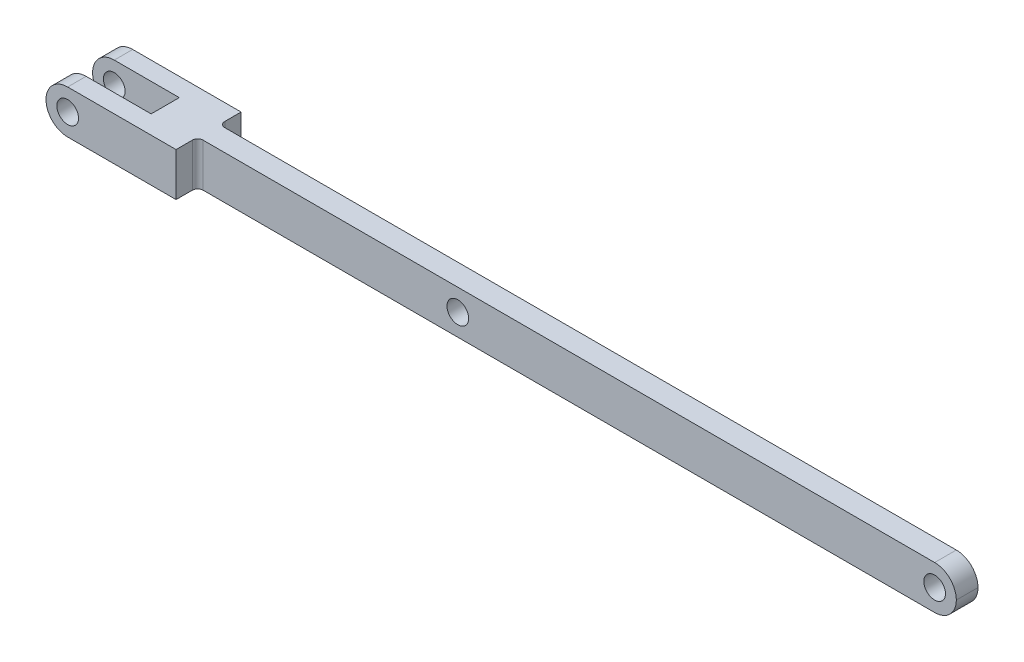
ISO-10303-21;
HEADER;
FILE_DESCRIPTION(('STEP AP214'),'2;1');
FILE_NAME('part.step','',(''),(''),'','','');
FILE_SCHEMA(('AUTOMOTIVE_DESIGN { 1 0 10303 214 1 1 1 1 }'));
ENDSEC;
DATA;
#1=APPLICATION_CONTEXT('core data for automotive mechanical design processes');
#2=APPLICATION_PROTOCOL_DEFINITION('international standard','automotive_design',2000,#1);
#3=PRODUCT_CONTEXT('',#1,'mechanical');
#4=PRODUCT('Part','Part','',(#3));
#5=PRODUCT_RELATED_PRODUCT_CATEGORY('part','',(#4));
#6=PRODUCT_DEFINITION_FORMATION('','',#4);
#7=PRODUCT_DEFINITION_CONTEXT('part definition',#1,'design');
#8=PRODUCT_DEFINITION('design','',#6,#7);
#9=PRODUCT_DEFINITION_SHAPE('','',#8);
#10=(LENGTH_UNIT() NAMED_UNIT(*) SI_UNIT(.MILLI.,.METRE.));
#11=(NAMED_UNIT(*) PLANE_ANGLE_UNIT() SI_UNIT($,.RADIAN.));
#12=(NAMED_UNIT(*) SI_UNIT($,.STERADIAN.) SOLID_ANGLE_UNIT());
#13=UNCERTAINTY_MEASURE_WITH_UNIT(LENGTH_MEASURE(1.E-05),#10,'distance_accuracy_value','');
#14=(GEOMETRIC_REPRESENTATION_CONTEXT(3) GLOBAL_UNCERTAINTY_ASSIGNED_CONTEXT((#13)) GLOBAL_UNIT_ASSIGNED_CONTEXT((#10,
#11,#12)) REPRESENTATION_CONTEXT('',''));
#15=CARTESIAN_POINT('',(0.,0.,0.));
#16=DIRECTION('',(0.,0.,1.));
#17=DIRECTION('',(1.,0.,0.));
#18=AXIS2_PLACEMENT_3D('',#15,#16,#17);
#19=CARTESIAN_POINT('',(0.,0.,10.));
#20=DIRECTION('',(0.,0.,-1.));
#21=DIRECTION('',(-1.,0.,0.));
#22=AXIS2_PLACEMENT_3D('',#19,#20,#21);
#23=CYLINDRICAL_SURFACE('',#22,20.);
#24=CARTESIAN_POINT('',(0.,0.,-13.));
#25=DIRECTION('',(0.,0.,-1.));
#26=DIRECTION('',(-1.,0.,0.));
#27=AXIS2_PLACEMENT_3D('',#24,#25,#26);
#28=CIRCLE('',#27,20.);
#29=CARTESIAN_POINT('',(0.,-20.,-13.));
#30=VERTEX_POINT('',#29);
#31=CARTESIAN_POINT('',(0.,20.,-13.));
#32=VERTEX_POINT('',#31);
#33=EDGE_CURVE('E153',#30,#32,#28,.T.);
#34=ORIENTED_EDGE('',*,*,#33,.T.);
#35=DIRECTION('',(0.,0.,-1.));
#36=VECTOR('',#35,1.);
#37=CARTESIAN_POINT('',(0.,20.,10.));
#38=LINE('',#37,#36);
#39=CARTESIAN_POINT('',(0.,20.,-30.));
#40=VERTEX_POINT('',#39);
#41=EDGE_CURVE('E246',#32,#40,#38,.T.);
#42=ORIENTED_EDGE('',*,*,#41,.T.);
#43=CARTESIAN_POINT('',(0.,0.,-30.));
#44=DIRECTION('',(0.,0.,1.));
#45=DIRECTION('',(1.,0.,0.));
#46=AXIS2_PLACEMENT_3D('',#43,#44,#45);
#47=CIRCLE('',#46,20.);
#48=CARTESIAN_POINT('',(0.,-20.,-30.));
#49=VERTEX_POINT('',#48);
#50=EDGE_CURVE('E184',#40,#49,#47,.T.);
#51=ORIENTED_EDGE('',*,*,#50,.T.);
#52=DIRECTION('',(0.,0.,-1.));
#53=VECTOR('',#52,1.);
#54=CARTESIAN_POINT('',(0.,-20.,10.));
#55=LINE('',#54,#53);
#56=EDGE_CURVE('E253',#30,#49,#55,.T.);
#57=ORIENTED_EDGE('',*,*,#56,.F.);
#58=EDGE_LOOP('',(#34,#42,#51,#57));
#59=FACE_BOUND('',#58,.T.);
#60=ADVANCED_FACE('F39',(#59),#23,.T.);
#61=CARTESIAN_POINT('',(0.,20.,30.));
#62=VERTEX_POINT('',#61);
#63=CARTESIAN_POINT('',(0.,20.,13.));
#64=VERTEX_POINT('',#63);
#65=EDGE_CURVE('E250',#62,#64,#38,.T.);
#66=ORIENTED_EDGE('',*,*,#65,.T.);
#67=CARTESIAN_POINT('',(0.,0.,13.));
#68=DIRECTION('',(0.,0.,1.));
#69=DIRECTION('',(1.,0.,0.));
#70=AXIS2_PLACEMENT_3D('',#67,#68,#69);
#71=CIRCLE('',#70,20.);
#72=CARTESIAN_POINT('',(0.,-20.,13.));
#73=VERTEX_POINT('',#72);
#74=EDGE_CURVE('E168',#64,#73,#71,.T.);
#75=ORIENTED_EDGE('',*,*,#74,.T.);
#76=CARTESIAN_POINT('',(0.,-20.,30.));
#77=VERTEX_POINT('',#76);
#78=EDGE_CURVE('E167',#77,#73,#55,.T.);
#79=ORIENTED_EDGE('',*,*,#78,.F.);
#80=CARTESIAN_POINT('',(0.,0.,30.));
#81=DIRECTION('',(0.,0.,1.));
#82=DIRECTION('',(1.,0.,0.));
#83=AXIS2_PLACEMENT_3D('',#80,#81,#82);
#84=CIRCLE('',#83,20.);
#85=EDGE_CURVE('E191',#62,#77,#84,.T.);
#86=ORIENTED_EDGE('',*,*,#85,.F.);
#87=EDGE_LOOP('',(#66,#75,#79,#86));
#88=FACE_BOUND('',#87,.T.);
#89=ADVANCED_FACE('F41',(#88),#23,.T.);
#90=CARTESIAN_POINT('',(0.,-20.,10.));
#91=DIRECTION('',(0.,1.,0.));
#92=DIRECTION('',(0.,0.,1.));
#93=AXIS2_PLACEMENT_3D('',#90,#91,#92);
#94=PLANE('',#93);
#95=DIRECTION('',(1.,0.,0.));
#96=VECTOR('',#95,1.);
#97=CARTESIAN_POINT('',(0.,-20.,-10.));
#98=LINE('',#97,#96);
#99=CARTESIAN_POINT('',(105.,-20.,-10.));
#100=VERTEX_POINT('',#99);
#101=CARTESIAN_POINT('',(780.,-20.,-10.));
#102=VERTEX_POINT('',#101);
#103=EDGE_CURVE('E205',#100,#102,#98,.T.);
#104=ORIENTED_EDGE('',*,*,#103,.T.);
#105=DIRECTION('',(0.,0.,-1.));
#106=VECTOR('',#105,1.);
#107=CARTESIAN_POINT('',(780.,-20.,10.));
#108=LINE('',#107,#106);
#109=CARTESIAN_POINT('',(780.,-20.,10.));
#110=VERTEX_POINT('',#109);
#111=EDGE_CURVE('E240',#102,#110,#108,.F.);
#112=ORIENTED_EDGE('',*,*,#111,.T.);
#113=DIRECTION('',(1.,0.,0.));
#114=VECTOR('',#113,1.);
#115=CARTESIAN_POINT('',(0.,-20.,10.));
#116=LINE('',#115,#114);
#117=CARTESIAN_POINT('',(105.,-20.,10.));
#118=VERTEX_POINT('',#117);
#119=EDGE_CURVE('E236',#118,#110,#116,.T.);
#120=ORIENTED_EDGE('',*,*,#119,.F.);
#121=CARTESIAN_POINT('',(105.,-20.,15.));
#122=DIRECTION('',(0.,1.,0.));
#123=DIRECTION('',(0.,0.,1.));
#124=AXIS2_PLACEMENT_3D('',#121,#122,#123);
#125=CIRCLE('',#124,5.);
#126=CARTESIAN_POINT('',(100.,-20.,15.));
#127=VERTEX_POINT('',#126);
#128=EDGE_CURVE('E220',#118,#127,#125,.T.);
#129=ORIENTED_EDGE('',*,*,#128,.T.);
#130=DIRECTION('',(0.,0.,-1.));
#131=VECTOR('',#130,1.);
#132=CARTESIAN_POINT('',(100.,-20.,30.));
#133=LINE('',#132,#131);
#134=CARTESIAN_POINT('',(100.,-20.,30.));
#135=VERTEX_POINT('',#134);
#136=EDGE_CURVE('E209',#135,#127,#133,.T.);
#137=ORIENTED_EDGE('',*,*,#136,.F.);
#138=DIRECTION('',(1.,0.,0.));
#139=VECTOR('',#138,1.);
#140=CARTESIAN_POINT('',(0.,-20.,30.));
#141=LINE('',#140,#139);
#142=EDGE_CURVE('E195',#77,#135,#141,.T.);
#143=ORIENTED_EDGE('',*,*,#142,.F.);
#144=ORIENTED_EDGE('',*,*,#78,.T.);
#145=DIRECTION('',(1.,0.,0.));
#146=VECTOR('',#145,1.);
#147=CARTESIAN_POINT('',(0.,-20.,13.));
#148=LINE('',#147,#146);
#149=CARTESIAN_POINT('',(60.,-20.,13.));
#150=VERTEX_POINT('',#149);
#151=EDGE_CURVE('E154',#73,#150,#148,.T.);
#152=ORIENTED_EDGE('',*,*,#151,.T.);
#153=DIRECTION('',(0.,0.,-1.));
#154=VECTOR('',#153,1.);
#155=CARTESIAN_POINT('',(60.,-20.,10.));
#156=LINE('',#155,#154);
#157=CARTESIAN_POINT('',(60.,-20.,-13.));
#158=VERTEX_POINT('',#157);
#159=EDGE_CURVE('E143',#150,#158,#156,.T.);
#160=ORIENTED_EDGE('',*,*,#159,.T.);
#161=DIRECTION('',(-1.,0.,0.));
#162=VECTOR('',#161,1.);
#163=CARTESIAN_POINT('',(0.,-20.,-13.));
#164=LINE('',#163,#162);
#165=EDGE_CURVE('E173',#158,#30,#164,.T.);
#166=ORIENTED_EDGE('',*,*,#165,.T.);
#167=ORIENTED_EDGE('',*,*,#56,.T.);
#168=DIRECTION('',(1.,0.,0.));
#169=VECTOR('',#168,1.);
#170=CARTESIAN_POINT('',(0.,-20.,-30.));
#171=LINE('',#170,#169);
#172=CARTESIAN_POINT('',(100.,-20.,-30.));
#173=VERTEX_POINT('',#172);
#174=EDGE_CURVE('E181',#49,#173,#171,.T.);
#175=ORIENTED_EDGE('',*,*,#174,.T.);
#176=DIRECTION('',(0.,0.,1.));
#177=VECTOR('',#176,1.);
#178=CARTESIAN_POINT('',(100.,-20.,-30.));
#179=LINE('',#178,#177);
#180=CARTESIAN_POINT('',(100.,-20.,-15.));
#181=VERTEX_POINT('',#180);
#182=EDGE_CURVE('E187',#173,#181,#179,.T.);
#183=ORIENTED_EDGE('',*,*,#182,.T.);
#184=CARTESIAN_POINT('',(105.,-20.,-15.));
#185=DIRECTION('',(0.,1.,0.));
#186=DIRECTION('',(0.,0.,1.));
#187=AXIS2_PLACEMENT_3D('',#184,#185,#186);
#188=CIRCLE('',#187,5.);
#189=EDGE_CURVE('E224',#181,#100,#188,.T.);
#190=ORIENTED_EDGE('',*,*,#189,.T.);
#191=EDGE_LOOP('',(#104,#112,#120,#129,#137,#143,#144,#152,#160,#166,#167,#175,#183,#190));
#192=FACE_BOUND('',#191,.T.);
#193=ADVANCED_FACE('F165',(#192),#94,.F.);
#194=CARTESIAN_POINT('',(0.,20.,10.));
#195=DIRECTION('',(0.,-1.,0.));
#196=DIRECTION('',(0.,0.,-1.));
#197=AXIS2_PLACEMENT_3D('',#194,#195,#196);
#198=PLANE('',#197);
#199=DIRECTION('',(-1.,0.,0.));
#200=VECTOR('',#199,1.);
#201=CARTESIAN_POINT('',(0.,20.,10.));
#202=LINE('',#201,#200);
#203=CARTESIAN_POINT('',(780.,20.,10.));
#204=VERTEX_POINT('',#203);
#205=CARTESIAN_POINT('',(105.,20.,10.));
#206=VERTEX_POINT('',#205);
#207=EDGE_CURVE('E243',#204,#206,#202,.T.);
#208=ORIENTED_EDGE('',*,*,#207,.F.);
#209=DIRECTION('',(0.,0.,-1.));
#210=VECTOR('',#209,1.);
#211=CARTESIAN_POINT('',(780.,20.,10.));
#212=LINE('',#211,#210);
#213=CARTESIAN_POINT('',(780.,20.,-10.));
#214=VERTEX_POINT('',#213);
#215=EDGE_CURVE('E11',#204,#214,#212,.T.);
#216=ORIENTED_EDGE('',*,*,#215,.T.);
#217=DIRECTION('',(-1.,0.,0.));
#218=VECTOR('',#217,1.);
#219=CARTESIAN_POINT('',(0.,20.,-10.));
#220=LINE('',#219,#218);
#221=CARTESIAN_POINT('',(105.,20.,-10.));
#222=VERTEX_POINT('',#221);
#223=EDGE_CURVE('E208',#214,#222,#220,.T.);
#224=ORIENTED_EDGE('',*,*,#223,.T.);
#225=CARTESIAN_POINT('',(105.,20.,-15.));
#226=DIRECTION('',(0.,-1.,0.));
#227=DIRECTION('',(0.,0.,-1.));
#228=AXIS2_PLACEMENT_3D('',#225,#226,#227);
#229=CIRCLE('',#228,5.);
#230=CARTESIAN_POINT('',(100.,20.,-15.));
#231=VERTEX_POINT('',#230);
#232=EDGE_CURVE('E222',#222,#231,#229,.T.);
#233=ORIENTED_EDGE('',*,*,#232,.T.);
#234=DIRECTION('',(0.,0.,1.));
#235=VECTOR('',#234,1.);
#236=CARTESIAN_POINT('',(100.,20.,-30.));
#237=LINE('',#236,#235);
#238=CARTESIAN_POINT('',(100.,20.,-30.));
#239=VERTEX_POINT('',#238);
#240=EDGE_CURVE('E192',#239,#231,#237,.T.);
#241=ORIENTED_EDGE('',*,*,#240,.F.);
#242=DIRECTION('',(-1.,0.,0.));
#243=VECTOR('',#242,1.);
#244=CARTESIAN_POINT('',(100.,20.,-30.));
#245=LINE('',#244,#243);
#246=EDGE_CURVE('E175',#239,#40,#245,.T.);
#247=ORIENTED_EDGE('',*,*,#246,.T.);
#248=ORIENTED_EDGE('',*,*,#41,.F.);
#249=DIRECTION('',(1.,0.,0.));
#250=VECTOR('',#249,1.);
#251=CARTESIAN_POINT('',(0.,20.,-13.));
#252=LINE('',#251,#250);
#253=CARTESIAN_POINT('',(60.,20.,-13.));
#254=VERTEX_POINT('',#253);
#255=EDGE_CURVE('E274',#32,#254,#252,.T.);
#256=ORIENTED_EDGE('',*,*,#255,.T.);
#257=DIRECTION('',(0.,0.,1.));
#258=VECTOR('',#257,1.);
#259=CARTESIAN_POINT('',(60.,20.,10.));
#260=LINE('',#259,#258);
#261=CARTESIAN_POINT('',(60.,20.,13.));
#262=VERTEX_POINT('',#261);
#263=EDGE_CURVE('E272',#254,#262,#260,.T.);
#264=ORIENTED_EDGE('',*,*,#263,.T.);
#265=DIRECTION('',(-1.,0.,0.));
#266=VECTOR('',#265,1.);
#267=CARTESIAN_POINT('',(0.,20.,13.));
#268=LINE('',#267,#266);
#269=EDGE_CURVE('E160',#262,#64,#268,.T.);
#270=ORIENTED_EDGE('',*,*,#269,.T.);
#271=ORIENTED_EDGE('',*,*,#65,.F.);
#272=DIRECTION('',(-1.,0.,0.));
#273=VECTOR('',#272,1.);
#274=CARTESIAN_POINT('',(100.,20.,30.));
#275=LINE('',#274,#273);
#276=CARTESIAN_POINT('',(100.,20.,30.));
#277=VERTEX_POINT('',#276);
#278=EDGE_CURVE('E188',#277,#62,#275,.T.);
#279=ORIENTED_EDGE('',*,*,#278,.F.);
#280=DIRECTION('',(0.,0.,-1.));
#281=VECTOR('',#280,1.);
#282=CARTESIAN_POINT('',(100.,20.,30.));
#283=LINE('',#282,#281);
#284=CARTESIAN_POINT('',(100.,20.,15.));
#285=VERTEX_POINT('',#284);
#286=EDGE_CURVE('E199',#277,#285,#283,.T.);
#287=ORIENTED_EDGE('',*,*,#286,.T.);
#288=CARTESIAN_POINT('',(105.,20.,15.));
#289=DIRECTION('',(0.,-1.,0.));
#290=DIRECTION('',(0.,0.,-1.));
#291=AXIS2_PLACEMENT_3D('',#288,#289,#290);
#292=CIRCLE('',#291,5.);
#293=EDGE_CURVE('E217',#285,#206,#292,.T.);
#294=ORIENTED_EDGE('',*,*,#293,.T.);
#295=EDGE_LOOP('',(#208,#216,#224,#233,#241,#247,#248,#256,#264,#270,#271,#279,#287,#294));
#296=FACE_BOUND('',#295,.T.);
#297=ADVANCED_FACE('F299',(#296),#198,.F.);
#298=CARTESIAN_POINT('',(0.,0.,10.));
#299=DIRECTION('',(0.,0.,1.));
#300=DIRECTION('',(1.,0.,0.));
#301=AXIS2_PLACEMENT_3D('',#298,#299,#300);
#302=PLANE('',#301);
#303=CARTESIAN_POINT('',(780.,0.,10.));
#304=DIRECTION('',(0.,0.,1.));
#305=DIRECTION('',(1.,0.,0.));
#306=AXIS2_PLACEMENT_3D('',#303,#304,#305);
#307=CIRCLE('',#306,9.99999999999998);
#308=CARTESIAN_POINT('',(790.,0.,10.));
#309=VERTEX_POINT('',#308);
#310=EDGE_CURVE('E234',#309,#309,#307,.T.);
#311=ORIENTED_EDGE('',*,*,#310,.F.);
#312=EDGE_LOOP('',(#311));
#313=FACE_BOUND('',#312,.T.);
#314=CARTESIAN_POINT('',(340.,0.,10.));
#315=DIRECTION('',(0.,0.,1.));
#316=DIRECTION('',(1.,0.,0.));
#317=AXIS2_PLACEMENT_3D('',#314,#315,#316);
#318=CIRCLE('',#317,10.);
#319=CARTESIAN_POINT('',(350.,0.,10.));
#320=VERTEX_POINT('',#319);
#321=EDGE_CURVE('E230',#320,#320,#318,.T.);
#322=ORIENTED_EDGE('',*,*,#321,.F.);
#323=EDGE_LOOP('',(#322));
#324=FACE_BOUND('',#323,.T.);
#325=ORIENTED_EDGE('',*,*,#119,.T.);
#326=CARTESIAN_POINT('',(780.,0.,10.));
#327=DIRECTION('',(0.,0.,1.));
#328=DIRECTION('',(1.,0.,0.));
#329=AXIS2_PLACEMENT_3D('',#326,#327,#328);
#330=CIRCLE('',#329,20.);
#331=CARTESIAN_POINT('',(800.,0.,10.));
#332=VERTEX_POINT('',#331);
#333=EDGE_CURVE('E47',#110,#332,#330,.T.);
#334=ORIENTED_EDGE('',*,*,#333,.T.);
#335=CARTESIAN_POINT('',(780.,0.,10.));
#336=DIRECTION('',(0.,0.,1.));
#337=DIRECTION('',(1.,0.,0.));
#338=AXIS2_PLACEMENT_3D('',#335,#336,#337);
#339=CIRCLE('',#338,20.);
#340=EDGE_CURVE('E57',#332,#204,#339,.T.);
#341=ORIENTED_EDGE('',*,*,#340,.T.);
#342=ORIENTED_EDGE('',*,*,#207,.T.);
#343=DIRECTION('',(0.,1.,0.));
#344=VECTOR('',#343,1.);
#345=CARTESIAN_POINT('',(105.,0.,10.));
#346=LINE('',#345,#344);
#347=EDGE_CURVE('E210',#206,#118,#346,.F.);
#348=ORIENTED_EDGE('',*,*,#347,.T.);
#349=EDGE_LOOP('',(#325,#334,#341,#342,#348));
#350=FACE_BOUND('',#349,.T.);
#351=ADVANCED_FACE('F285',(#313,#324,#350),#302,.T.);
#352=CARTESIAN_POINT('',(0.,0.,-10.));
#353=DIRECTION('',(0.,0.,1.));
#354=DIRECTION('',(1.,0.,0.));
#355=AXIS2_PLACEMENT_3D('',#352,#353,#354);
#356=PLANE('',#355);
#357=CARTESIAN_POINT('',(780.,0.,-10.));
#358=DIRECTION('',(0.,0.,1.));
#359=DIRECTION('',(1.,0.,0.));
#360=AXIS2_PLACEMENT_3D('',#357,#358,#359);
#361=CIRCLE('',#360,9.99999999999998);
#362=CARTESIAN_POINT('',(790.,0.,-10.));
#363=VERTEX_POINT('',#362);
#364=EDGE_CURVE('E231',#363,#363,#361,.T.);
#365=ORIENTED_EDGE('',*,*,#364,.T.);
#366=EDGE_LOOP('',(#365));
#367=FACE_BOUND('',#366,.T.);
#368=CARTESIAN_POINT('',(340.,0.,-10.));
#369=DIRECTION('',(0.,0.,1.));
#370=DIRECTION('',(1.,0.,0.));
#371=AXIS2_PLACEMENT_3D('',#368,#369,#370);
#372=CIRCLE('',#371,10.);
#373=CARTESIAN_POINT('',(350.,0.,-10.));
#374=VERTEX_POINT('',#373);
#375=EDGE_CURVE('E227',#374,#374,#372,.T.);
#376=ORIENTED_EDGE('',*,*,#375,.T.);
#377=EDGE_LOOP('',(#376));
#378=FACE_BOUND('',#377,.T.);
#379=CARTESIAN_POINT('',(780.,0.,-10.));
#380=DIRECTION('',(0.,0.,1.));
#381=DIRECTION('',(1.,0.,0.));
#382=AXIS2_PLACEMENT_3D('',#379,#380,#381);
#383=CIRCLE('',#382,20.);
#384=CARTESIAN_POINT('',(800.,0.,-10.));
#385=VERTEX_POINT('',#384);
#386=EDGE_CURVE('E226',#214,#385,#383,.F.);
#387=ORIENTED_EDGE('',*,*,#386,.T.);
#388=CARTESIAN_POINT('',(780.,0.,-10.));
#389=DIRECTION('',(0.,0.,1.));
#390=DIRECTION('',(1.,0.,0.));
#391=AXIS2_PLACEMENT_3D('',#388,#389,#390);
#392=CIRCLE('',#391,20.);
#393=EDGE_CURVE('E238',#385,#102,#392,.F.);
#394=ORIENTED_EDGE('',*,*,#393,.T.);
#395=ORIENTED_EDGE('',*,*,#103,.F.);
#396=DIRECTION('',(0.,1.,0.));
#397=VECTOR('',#396,1.);
#398=CARTESIAN_POINT('',(105.,0.,-10.));
#399=LINE('',#398,#397);
#400=EDGE_CURVE('E212',#100,#222,#399,.T.);
#401=ORIENTED_EDGE('',*,*,#400,.T.);
#402=ORIENTED_EDGE('',*,*,#223,.F.);
#403=EDGE_LOOP('',(#387,#394,#395,#401,#402));
#404=FACE_BOUND('',#403,.T.);
#405=ADVANCED_FACE('F333',(#367,#378,#404),#356,.F.);
#406=CARTESIAN_POINT('',(100.,20.,30.));
#407=DIRECTION('',(-1.,0.,0.));
#408=DIRECTION('',(0.,0.,1.));
#409=AXIS2_PLACEMENT_3D('',#406,#407,#408);
#410=PLANE('',#409);
#411=ORIENTED_EDGE('',*,*,#136,.T.);
#412=DIRECTION('',(0.,1.,0.));
#413=VECTOR('',#412,1.);
#414=CARTESIAN_POINT('',(100.,20.,15.));
#415=LINE('',#414,#413);
#416=EDGE_CURVE('E277',#127,#285,#415,.T.);
#417=ORIENTED_EDGE('',*,*,#416,.T.);
#418=ORIENTED_EDGE('',*,*,#286,.F.);
#419=DIRECTION('',(0.,1.,0.));
#420=VECTOR('',#419,1.);
#421=CARTESIAN_POINT('',(100.,20.,30.));
#422=LINE('',#421,#420);
#423=EDGE_CURVE('E197',#135,#277,#422,.T.);
#424=ORIENTED_EDGE('',*,*,#423,.F.);
#425=EDGE_LOOP('',(#411,#417,#418,#424));
#426=FACE_BOUND('',#425,.T.);
#427=ADVANCED_FACE('F295',(#426),#410,.F.);
#428=CARTESIAN_POINT('',(0.,0.,30.));
#429=DIRECTION('',(0.,0.,1.));
#430=DIRECTION('',(1.,0.,0.));
#431=AXIS2_PLACEMENT_3D('',#428,#429,#430);
#432=PLANE('',#431);
#433=CARTESIAN_POINT('',(0.,0.,30.));
#434=DIRECTION('',(0.,0.,1.));
#435=DIRECTION('',(1.,0.,0.));
#436=AXIS2_PLACEMENT_3D('',#433,#434,#435);
#437=CIRCLE('',#436,10.);
#438=CARTESIAN_POINT('',(10.,0.,30.));
#439=VERTEX_POINT('',#438);
#440=EDGE_CURVE('E282',#439,#439,#437,.T.);
#441=ORIENTED_EDGE('',*,*,#440,.F.);
#442=EDGE_LOOP('',(#441));
#443=FACE_BOUND('',#442,.T.);
#444=ORIENTED_EDGE('',*,*,#278,.T.);
#445=ORIENTED_EDGE('',*,*,#85,.T.);
#446=ORIENTED_EDGE('',*,*,#142,.T.);
#447=ORIENTED_EDGE('',*,*,#423,.T.);
#448=EDGE_LOOP('',(#444,#445,#446,#447));
#449=FACE_BOUND('',#448,.T.);
#450=ADVANCED_FACE('F302',(#443,#449),#432,.T.);
#451=CARTESIAN_POINT('',(100.,20.,-30.));
#452=DIRECTION('',(1.,0.,0.));
#453=DIRECTION('',(0.,0.,-1.));
#454=AXIS2_PLACEMENT_3D('',#451,#452,#453);
#455=PLANE('',#454);
#456=ORIENTED_EDGE('',*,*,#240,.T.);
#457=DIRECTION('',(0.,1.,0.));
#458=VECTOR('',#457,1.);
#459=CARTESIAN_POINT('',(100.,20.,-15.));
#460=LINE('',#459,#458);
#461=EDGE_CURVE('E215',#231,#181,#460,.F.);
#462=ORIENTED_EDGE('',*,*,#461,.T.);
#463=ORIENTED_EDGE('',*,*,#182,.F.);
#464=DIRECTION('',(0.,1.,0.));
#465=VECTOR('',#464,1.);
#466=CARTESIAN_POINT('',(100.,20.,-30.));
#467=LINE('',#466,#465);
#468=EDGE_CURVE('E178',#173,#239,#467,.T.);
#469=ORIENTED_EDGE('',*,*,#468,.T.);
#470=EDGE_LOOP('',(#456,#462,#463,#469));
#471=FACE_BOUND('',#470,.T.);
#472=ADVANCED_FACE('F342',(#471),#455,.T.);
#473=CARTESIAN_POINT('',(0.,0.,-30.));
#474=DIRECTION('',(0.,0.,-1.));
#475=DIRECTION('',(1.,0.,0.));
#476=AXIS2_PLACEMENT_3D('',#473,#474,#475);
#477=PLANE('',#476);
#478=CARTESIAN_POINT('',(0.,0.,-30.));
#479=DIRECTION('',(0.,0.,-1.));
#480=DIRECTION('',(-1.,0.,0.));
#481=AXIS2_PLACEMENT_3D('',#478,#479,#480);
#482=CIRCLE('',#481,10.);
#483=CARTESIAN_POINT('',(-10.,0.,-30.));
#484=VERTEX_POINT('',#483);
#485=EDGE_CURVE('E161',#484,#484,#482,.T.);
#486=ORIENTED_EDGE('',*,*,#485,.F.);
#487=EDGE_LOOP('',(#486));
#488=FACE_BOUND('',#487,.T.);
#489=ORIENTED_EDGE('',*,*,#246,.F.);
#490=ORIENTED_EDGE('',*,*,#468,.F.);
#491=ORIENTED_EDGE('',*,*,#174,.F.);
#492=ORIENTED_EDGE('',*,*,#50,.F.);
#493=EDGE_LOOP('',(#489,#490,#491,#492));
#494=FACE_BOUND('',#493,.T.);
#495=ADVANCED_FACE('F346',(#488,#494),#477,.T.);
#496=CARTESIAN_POINT('',(-20.,-20.00005,-13.));
#497=DIRECTION('',(0.,0.,-1.));
#498=DIRECTION('',(-1.,0.,0.));
#499=AXIS2_PLACEMENT_3D('',#496,#497,#498);
#500=PLANE('',#499);
#501=CARTESIAN_POINT('',(0.,0.,-13.));
#502=DIRECTION('',(0.,0.,-1.));
#503=DIRECTION('',(-1.,0.,0.));
#504=AXIS2_PLACEMENT_3D('',#501,#502,#503);
#505=CIRCLE('',#504,10.);
#506=CARTESIAN_POINT('',(-10.,0.,-13.));
#507=VERTEX_POINT('',#506);
#508=EDGE_CURVE('E281',#507,#507,#505,.T.);
#509=ORIENTED_EDGE('',*,*,#508,.T.);
#510=EDGE_LOOP('',(#509));
#511=FACE_BOUND('',#510,.T.);
#512=DIRECTION('',(0.,1.,0.));
#513=VECTOR('',#512,1.);
#514=CARTESIAN_POINT('',(60.,-20.00005,-13.));
#515=LINE('',#514,#513);
#516=EDGE_CURVE('E149',#158,#254,#515,.T.);
#517=ORIENTED_EDGE('',*,*,#516,.T.);
#518=ORIENTED_EDGE('',*,*,#255,.F.);
#519=ORIENTED_EDGE('',*,*,#33,.F.);
#520=ORIENTED_EDGE('',*,*,#165,.F.);
#521=EDGE_LOOP('',(#517,#518,#519,#520));
#522=FACE_BOUND('',#521,.T.);
#523=ADVANCED_FACE('F307',(#511,#522),#500,.F.);
#524=CARTESIAN_POINT('',(60.,-20.00005,-13.));
#525=DIRECTION('',(1.,0.,0.));
#526=DIRECTION('',(0.,0.,-1.));
#527=AXIS2_PLACEMENT_3D('',#524,#525,#526);
#528=PLANE('',#527);
#529=DIRECTION('',(0.,1.,0.));
#530=VECTOR('',#529,1.);
#531=CARTESIAN_POINT('',(60.,-20.00005,13.));
#532=LINE('',#531,#530);
#533=EDGE_CURVE('E146',#150,#262,#532,.T.);
#534=ORIENTED_EDGE('',*,*,#533,.T.);
#535=ORIENTED_EDGE('',*,*,#263,.F.);
#536=ORIENTED_EDGE('',*,*,#516,.F.);
#537=ORIENTED_EDGE('',*,*,#159,.F.);
#538=EDGE_LOOP('',(#534,#535,#536,#537));
#539=FACE_BOUND('',#538,.T.);
#540=ADVANCED_FACE('F145',(#539),#528,.F.);
#541=CARTESIAN_POINT('',(-20.,-20.00005,13.));
#542=DIRECTION('',(0.,0.,1.));
#543=DIRECTION('',(1.,0.,0.));
#544=AXIS2_PLACEMENT_3D('',#541,#542,#543);
#545=PLANE('',#544);
#546=CARTESIAN_POINT('',(0.,0.,13.));
#547=DIRECTION('',(0.,0.,1.));
#548=DIRECTION('',(1.,0.,0.));
#549=AXIS2_PLACEMENT_3D('',#546,#547,#548);
#550=CIRCLE('',#549,10.);
#551=CARTESIAN_POINT('',(10.,0.,13.));
#552=VERTEX_POINT('',#551);
#553=EDGE_CURVE('E278',#552,#552,#550,.T.);
#554=ORIENTED_EDGE('',*,*,#553,.T.);
#555=EDGE_LOOP('',(#554));
#556=FACE_BOUND('',#555,.T.);
#557=ORIENTED_EDGE('',*,*,#74,.F.);
#558=ORIENTED_EDGE('',*,*,#269,.F.);
#559=ORIENTED_EDGE('',*,*,#533,.F.);
#560=ORIENTED_EDGE('',*,*,#151,.F.);
#561=EDGE_LOOP('',(#557,#558,#559,#560));
#562=FACE_BOUND('',#561,.T.);
#563=ADVANCED_FACE('F157',(#556,#562),#545,.F.);
#564=CARTESIAN_POINT('',(0.,0.,-30.000025));
#565=DIRECTION('',(0.,0.,1.));
#566=DIRECTION('',(1.,0.,0.));
#567=AXIS2_PLACEMENT_3D('',#564,#565,#566);
#568=CYLINDRICAL_SURFACE('',#567,10.);
#569=ORIENTED_EDGE('',*,*,#440,.T.);
#570=EDGE_LOOP('',(#569));
#571=FACE_BOUND('',#570,.T.);
#572=ORIENTED_EDGE('',*,*,#553,.F.);
#573=EDGE_LOOP('',(#572));
#574=FACE_BOUND('',#573,.T.);
#575=ADVANCED_FACE('F380',(#571,#574),#568,.F.);
#576=ORIENTED_EDGE('',*,*,#485,.T.);
#577=EDGE_LOOP('',(#576));
#578=FACE_BOUND('',#577,.T.);
#579=ORIENTED_EDGE('',*,*,#508,.F.);
#580=EDGE_LOOP('',(#579));
#581=FACE_BOUND('',#580,.T.);
#582=ADVANCED_FACE('F387',(#578,#581),#568,.F.);
#583=CARTESIAN_POINT('',(105.,20.,15.));
#584=DIRECTION('',(0.,1.,0.));
#585=DIRECTION('',(0.,0.,1.));
#586=AXIS2_PLACEMENT_3D('',#583,#584,#585);
#587=CYLINDRICAL_SURFACE('',#586,5.);
#588=ORIENTED_EDGE('',*,*,#128,.F.);
#589=ORIENTED_EDGE('',*,*,#347,.F.);
#590=ORIENTED_EDGE('',*,*,#293,.F.);
#591=ORIENTED_EDGE('',*,*,#416,.F.);
#592=EDGE_LOOP('',(#588,#589,#590,#591));
#593=FACE_BOUND('',#592,.T.);
#594=ADVANCED_FACE('F292',(#593),#587,.F.);
#595=CARTESIAN_POINT('',(105.,0.,-15.));
#596=DIRECTION('',(0.,1.,0.));
#597=DIRECTION('',(0.,0.,1.));
#598=AXIS2_PLACEMENT_3D('',#595,#596,#597);
#599=CYLINDRICAL_SURFACE('',#598,5.);
#600=ORIENTED_EDGE('',*,*,#189,.F.);
#601=ORIENTED_EDGE('',*,*,#461,.F.);
#602=ORIENTED_EDGE('',*,*,#232,.F.);
#603=ORIENTED_EDGE('',*,*,#400,.F.);
#604=EDGE_LOOP('',(#600,#601,#602,#603));
#605=FACE_BOUND('',#604,.T.);
#606=ADVANCED_FACE('F338',(#605),#599,.F.);
#607=CARTESIAN_POINT('',(340.,0.,-30.));
#608=DIRECTION('',(0.,0.,1.));
#609=DIRECTION('',(1.,0.,0.));
#610=AXIS2_PLACEMENT_3D('',#607,#608,#609);
#611=CYLINDRICAL_SURFACE('',#610,10.);
#612=ORIENTED_EDGE('',*,*,#321,.T.);
#613=EDGE_LOOP('',(#612));
#614=FACE_BOUND('',#613,.T.);
#615=ORIENTED_EDGE('',*,*,#375,.F.);
#616=EDGE_LOOP('',(#615));
#617=FACE_BOUND('',#616,.T.);
#618=ADVANCED_FACE('F395',(#614,#617),#611,.F.);
#619=CARTESIAN_POINT('',(780.,0.,-30.));
#620=DIRECTION('',(0.,0.,1.));
#621=DIRECTION('',(1.,0.,0.));
#622=AXIS2_PLACEMENT_3D('',#619,#620,#621);
#623=CYLINDRICAL_SURFACE('',#622,9.99999999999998);
#624=ORIENTED_EDGE('',*,*,#310,.T.);
#625=EDGE_LOOP('',(#624));
#626=FACE_BOUND('',#625,.T.);
#627=ORIENTED_EDGE('',*,*,#364,.F.);
#628=EDGE_LOOP('',(#627));
#629=FACE_BOUND('',#628,.T.);
#630=ADVANCED_FACE('F398',(#626,#629),#623,.F.);
#631=CARTESIAN_POINT('',(780.,0.,10.));
#632=DIRECTION('',(0.,0.,-1.));
#633=DIRECTION('',(-1.,0.,0.));
#634=AXIS2_PLACEMENT_3D('',#631,#632,#633);
#635=CYLINDRICAL_SURFACE('',#634,20.);
#636=ORIENTED_EDGE('',*,*,#215,.F.);
#637=ORIENTED_EDGE('',*,*,#340,.F.);
#638=DIRECTION('',(0.,0.,-1.));
#639=VECTOR('',#638,1.);
#640=CARTESIAN_POINT('',(800.,0.,10.));
#641=LINE('',#640,#639);
#642=EDGE_CURVE('E320',#385,#332,#641,.F.);
#643=ORIENTED_EDGE('',*,*,#642,.F.);
#644=ORIENTED_EDGE('',*,*,#386,.F.);
#645=EDGE_LOOP('',(#636,#637,#643,#644));
#646=FACE_BOUND('',#645,.T.);
#647=ADVANCED_FACE('F329',(#646),#635,.T.);
#648=CARTESIAN_POINT('',(780.,0.,10.));
#649=DIRECTION('',(0.,0.,-1.));
#650=DIRECTION('',(-1.,0.,0.));
#651=AXIS2_PLACEMENT_3D('',#648,#649,#650);
#652=CYLINDRICAL_SURFACE('',#651,20.);
#653=ORIENTED_EDGE('',*,*,#333,.F.);
#654=ORIENTED_EDGE('',*,*,#111,.F.);
#655=ORIENTED_EDGE('',*,*,#393,.F.);
#656=ORIENTED_EDGE('',*,*,#642,.T.);
#657=EDGE_LOOP('',(#653,#654,#655,#656));
#658=FACE_BOUND('',#657,.T.);
#659=ADVANCED_FACE('F325',(#658),#652,.T.);
#660=CLOSED_SHELL('',(#60,#89,#193,#297,#351,#405,#427,#450,#472,#495,#523,#540,#563,#575,#582,
#594,#606,#618,#630,#647,#659));
#661=MANIFOLD_SOLID_BREP('B2',#660);
#662=ADVANCED_BREP_SHAPE_REPRESENTATION('',(#18,#661),#14);
#663=SHAPE_DEFINITION_REPRESENTATION(#9,#662);
ENDSEC;
END-ISO-10303-21;
